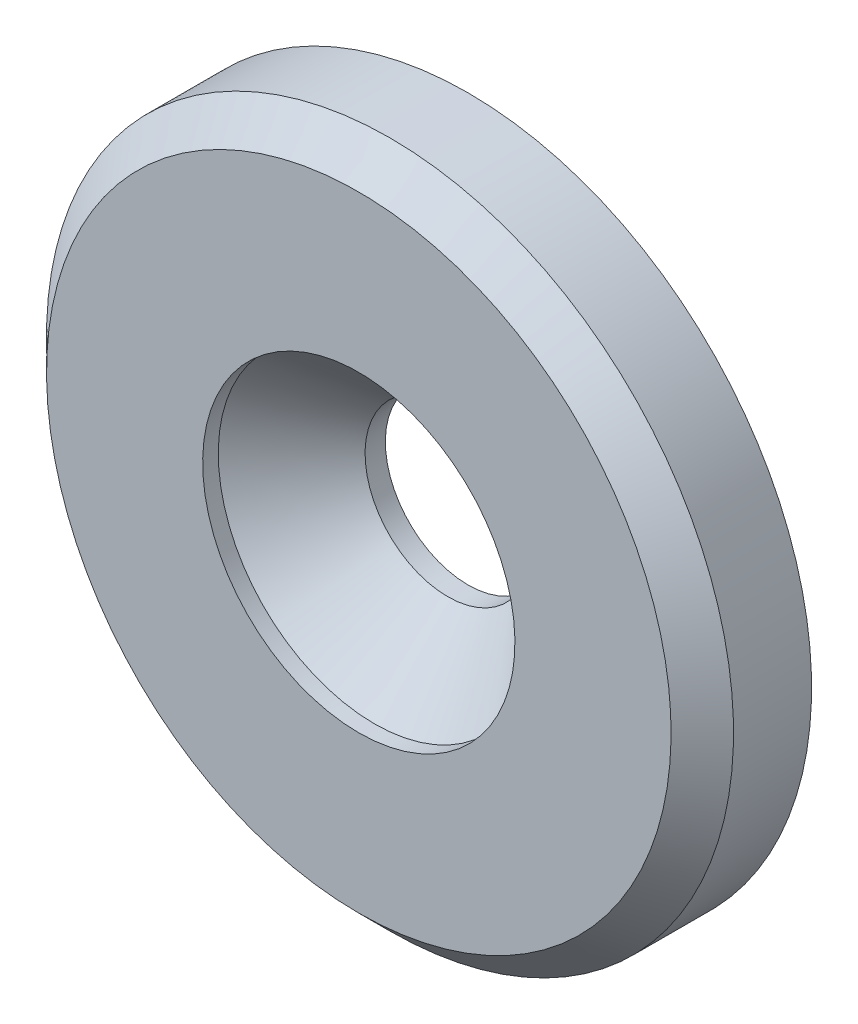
ISO-10303-21;
HEADER;
FILE_DESCRIPTION(('STEP AP214'),'2;1');
FILE_NAME('part.step','',(''),(''),'','','');
FILE_SCHEMA(('AUTOMOTIVE_DESIGN { 1 0 10303 214 1 1 1 1 }'));
ENDSEC;
DATA;
#1=APPLICATION_CONTEXT('core data for automotive mechanical design processes');
#2=APPLICATION_PROTOCOL_DEFINITION('international standard','automotive_design',2000,#1);
#3=PRODUCT_CONTEXT('',#1,'mechanical');
#4=PRODUCT('Part','Part','',(#3));
#5=PRODUCT_RELATED_PRODUCT_CATEGORY('part','',(#4));
#6=PRODUCT_DEFINITION_FORMATION('','',#4);
#7=PRODUCT_DEFINITION_CONTEXT('part definition',#1,'design');
#8=PRODUCT_DEFINITION('design','',#6,#7);
#9=PRODUCT_DEFINITION_SHAPE('','',#8);
#10=(LENGTH_UNIT() NAMED_UNIT(*) SI_UNIT(.MILLI.,.METRE.));
#11=(NAMED_UNIT(*) PLANE_ANGLE_UNIT() SI_UNIT($,.RADIAN.));
#12=(NAMED_UNIT(*) SI_UNIT($,.STERADIAN.) SOLID_ANGLE_UNIT());
#13=UNCERTAINTY_MEASURE_WITH_UNIT(LENGTH_MEASURE(1.E-05),#10,'distance_accuracy_value','');
#14=(GEOMETRIC_REPRESENTATION_CONTEXT(3) GLOBAL_UNCERTAINTY_ASSIGNED_CONTEXT((#13)) GLOBAL_UNIT_ASSIGNED_CONTEXT((#10,
#11,#12)) REPRESENTATION_CONTEXT('',''));
#15=CARTESIAN_POINT('',(0.,0.,0.));
#16=DIRECTION('',(0.,0.,1.));
#17=DIRECTION('',(1.,0.,0.));
#18=AXIS2_PLACEMENT_3D('',#15,#16,#17);
#19=CARTESIAN_POINT('',(0.,0.,0.65));
#20=DIRECTION('',(0.,0.,1.));
#21=DIRECTION('',(0.,-1.,0.));
#22=AXIS2_PLACEMENT_3D('',#19,#20,#21);
#23=CONICAL_SURFACE('',#22,2.65,0.785398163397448);
#24=CARTESIAN_POINT('',(0.,0.,3.));
#25=DIRECTION('',(0.,0.,1.));
#26=DIRECTION('',(0.,-1.,0.));
#27=AXIS2_PLACEMENT_3D('',#24,#25,#26);
#28=CIRCLE('',#27,5.);
#29=CARTESIAN_POINT('',(0.,-5.,3.));
#30=VERTEX_POINT('',#29);
#31=EDGE_CURVE('E37',#30,#30,#28,.T.);
#32=ORIENTED_EDGE('',*,*,#31,.T.);
#33=EDGE_LOOP('',(#32));
#34=FACE_BOUND('',#33,.T.);
#35=CARTESIAN_POINT('',(0.,0.,0.65));
#36=DIRECTION('',(0.,0.,1.));
#37=DIRECTION('',(0.,-1.,0.));
#38=AXIS2_PLACEMENT_3D('',#35,#36,#37);
#39=CIRCLE('',#38,2.65);
#40=CARTESIAN_POINT('',(0.,-2.65,0.65));
#41=VERTEX_POINT('',#40);
#42=EDGE_CURVE('E8',#41,#41,#39,.T.);
#43=ORIENTED_EDGE('',*,*,#42,.F.);
#44=EDGE_LOOP('',(#43));
#45=FACE_BOUND('',#44,.T.);
#46=ADVANCED_FACE('F12',(#34,#45),#23,.F.);
#47=CARTESIAN_POINT('',(0.,0.,3.82927951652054));
#48=DIRECTION('',(0.,0.,1.));
#49=DIRECTION('',(0.,-1.,0.));
#50=AXIS2_PLACEMENT_3D('',#47,#48,#49);
#51=CYLINDRICAL_SURFACE('',#50,2.65);
#52=ORIENTED_EDGE('',*,*,#42,.T.);
#53=EDGE_LOOP('',(#52));
#54=FACE_BOUND('',#53,.T.);
#55=CARTESIAN_POINT('',(0.,0.,0.));
#56=DIRECTION('',(0.,0.,1.));
#57=DIRECTION('',(0.,-1.,0.));
#58=AXIS2_PLACEMENT_3D('',#55,#56,#57);
#59=CIRCLE('',#58,2.65);
#60=CARTESIAN_POINT('',(0.,-2.65,0.));
#61=VERTEX_POINT('',#60);
#62=EDGE_CURVE('E18',#61,#61,#59,.T.);
#63=ORIENTED_EDGE('',*,*,#62,.F.);
#64=EDGE_LOOP('',(#63));
#65=FACE_BOUND('',#64,.T.);
#66=ADVANCED_FACE('F57',(#54,#65),#51,.F.);
#67=CARTESIAN_POINT('',(-2.65,0.,0.));
#68=DIRECTION('',(0.,0.,-1.));
#69=DIRECTION('',(0.,1.,0.));
#70=AXIS2_PLACEMENT_3D('',#67,#68,#69);
#71=PLANE('',#70);
#72=ORIENTED_EDGE('',*,*,#62,.T.);
#73=EDGE_LOOP('',(#72));
#74=FACE_BOUND('',#73,.T.);
#75=CARTESIAN_POINT('',(0.,0.,0.));
#76=DIRECTION('',(0.,0.,1.));
#77=DIRECTION('',(0.,-1.,0.));
#78=AXIS2_PLACEMENT_3D('',#75,#76,#77);
#79=CIRCLE('',#78,11.);
#80=CARTESIAN_POINT('',(0.,-11.,0.));
#81=VERTEX_POINT('',#80);
#82=EDGE_CURVE('E22',#81,#81,#79,.T.);
#83=ORIENTED_EDGE('',*,*,#82,.F.);
#84=EDGE_LOOP('',(#83));
#85=FACE_BOUND('',#84,.T.);
#86=ADVANCED_FACE('F62',(#74,#85),#71,.T.);
#87=CARTESIAN_POINT('',(0.,0.,3.82927951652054));
#88=DIRECTION('',(0.,0.,1.));
#89=DIRECTION('',(0.,-1.,0.));
#90=AXIS2_PLACEMENT_3D('',#87,#88,#89);
#91=CYLINDRICAL_SURFACE('',#90,11.);
#92=ORIENTED_EDGE('',*,*,#82,.T.);
#93=EDGE_LOOP('',(#92));
#94=FACE_BOUND('',#93,.T.);
#95=CARTESIAN_POINT('',(0.,0.,2.5));
#96=DIRECTION('',(0.,0.,1.));
#97=DIRECTION('',(0.,-1.,0.));
#98=AXIS2_PLACEMENT_3D('',#95,#96,#97);
#99=CIRCLE('',#98,11.);
#100=CARTESIAN_POINT('',(0.,-11.,2.5));
#101=VERTEX_POINT('',#100);
#102=EDGE_CURVE('E26',#101,#101,#99,.T.);
#103=ORIENTED_EDGE('',*,*,#102,.F.);
#104=EDGE_LOOP('',(#103));
#105=FACE_BOUND('',#104,.T.);
#106=ADVANCED_FACE('F67',(#94,#105),#91,.T.);
#107=CARTESIAN_POINT('',(0.,0.,3.5));
#108=DIRECTION('',(0.,0.,-1.));
#109=DIRECTION('',(0.,1.,0.));
#110=AXIS2_PLACEMENT_3D('',#107,#108,#109);
#111=CONICAL_SURFACE('',#110,10.,0.785398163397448);
#112=ORIENTED_EDGE('',*,*,#102,.T.);
#113=EDGE_LOOP('',(#112));
#114=FACE_BOUND('',#113,.T.);
#115=CARTESIAN_POINT('',(0.,0.,3.5));
#116=DIRECTION('',(0.,0.,1.));
#117=DIRECTION('',(0.,-1.,0.));
#118=AXIS2_PLACEMENT_3D('',#115,#116,#117);
#119=CIRCLE('',#118,10.);
#120=CARTESIAN_POINT('',(0.,-10.,3.5));
#121=VERTEX_POINT('',#120);
#122=EDGE_CURVE('E31',#121,#121,#119,.T.);
#123=ORIENTED_EDGE('',*,*,#122,.F.);
#124=EDGE_LOOP('',(#123));
#125=FACE_BOUND('',#124,.T.);
#126=ADVANCED_FACE('F53',(#114,#125),#111,.T.);
#127=CARTESIAN_POINT('',(-5.,0.,3.5));
#128=DIRECTION('',(0.,0.,1.));
#129=DIRECTION('',(0.,-1.,0.));
#130=AXIS2_PLACEMENT_3D('',#127,#128,#129);
#131=PLANE('',#130);
#132=ORIENTED_EDGE('',*,*,#122,.T.);
#133=EDGE_LOOP('',(#132));
#134=FACE_BOUND('',#133,.T.);
#135=CARTESIAN_POINT('',(0.,0.,3.5));
#136=DIRECTION('',(0.,0.,1.));
#137=DIRECTION('',(0.,-1.,0.));
#138=AXIS2_PLACEMENT_3D('',#135,#136,#137);
#139=CIRCLE('',#138,5.);
#140=CARTESIAN_POINT('',(0.,-5.,3.5));
#141=VERTEX_POINT('',#140);
#142=EDGE_CURVE('E34',#141,#141,#139,.T.);
#143=ORIENTED_EDGE('',*,*,#142,.F.);
#144=EDGE_LOOP('',(#143));
#145=FACE_BOUND('',#144,.T.);
#146=ADVANCED_FACE('F45',(#134,#145),#131,.T.);
#147=CARTESIAN_POINT('',(0.,0.,3.82927951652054));
#148=DIRECTION('',(0.,0.,1.));
#149=DIRECTION('',(0.,-1.,0.));
#150=AXIS2_PLACEMENT_3D('',#147,#148,#149);
#151=CYLINDRICAL_SURFACE('',#150,5.);
#152=ORIENTED_EDGE('',*,*,#142,.T.);
#153=EDGE_LOOP('',(#152));
#154=FACE_BOUND('',#153,.T.);
#155=ORIENTED_EDGE('',*,*,#31,.F.);
#156=EDGE_LOOP('',(#155));
#157=FACE_BOUND('',#156,.T.);
#158=ADVANCED_FACE('F43',(#154,#157),#151,.F.);
#159=CLOSED_SHELL('',(#46,#66,#86,#106,#126,#146,#158));
#160=MANIFOLD_SOLID_BREP('B1',#159);
#161=ADVANCED_BREP_SHAPE_REPRESENTATION('',(#18,#160),#14);
#162=SHAPE_DEFINITION_REPRESENTATION(#9,#161);
ENDSEC;
END-ISO-10303-21;
